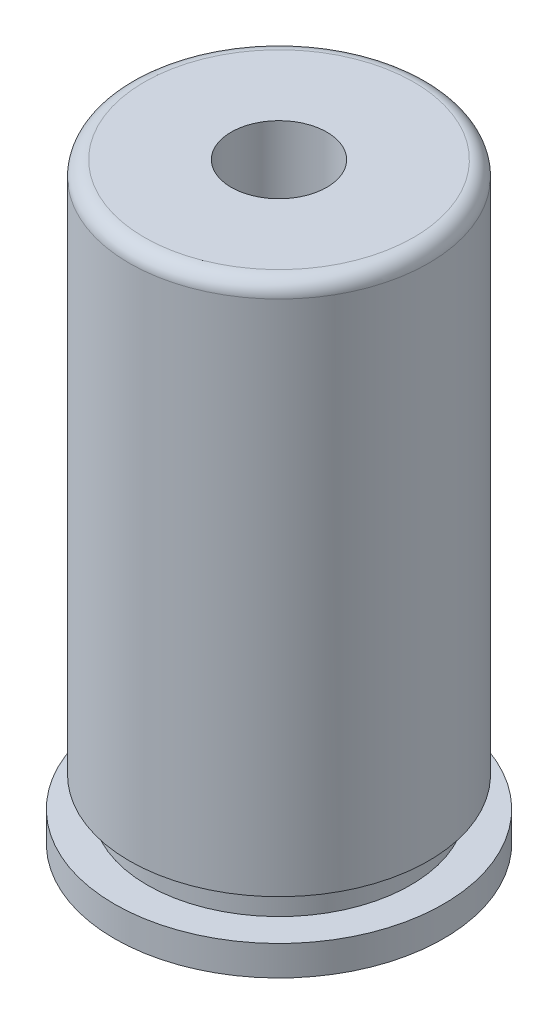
ISO-10303-21;
HEADER;
FILE_DESCRIPTION(('STEP AP214'),'2;1');
FILE_NAME('part.step','',(''),(''),'','','');
FILE_SCHEMA(('AUTOMOTIVE_DESIGN { 1 0 10303 214 1 1 1 1 }'));
ENDSEC;
DATA;
#1=APPLICATION_CONTEXT('core data for automotive mechanical design processes');
#2=APPLICATION_PROTOCOL_DEFINITION('international standard','automotive_design',2000,#1);
#3=PRODUCT_CONTEXT('',#1,'mechanical');
#4=PRODUCT('Part','Part','',(#3));
#5=PRODUCT_RELATED_PRODUCT_CATEGORY('part','',(#4));
#6=PRODUCT_DEFINITION_FORMATION('','',#4);
#7=PRODUCT_DEFINITION_CONTEXT('part definition',#1,'design');
#8=PRODUCT_DEFINITION('design','',#6,#7);
#9=PRODUCT_DEFINITION_SHAPE('','',#8);
#10=(LENGTH_UNIT() NAMED_UNIT(*) SI_UNIT(.MILLI.,.METRE.));
#11=(NAMED_UNIT(*) PLANE_ANGLE_UNIT() SI_UNIT($,.RADIAN.));
#12=(NAMED_UNIT(*) SI_UNIT($,.STERADIAN.) SOLID_ANGLE_UNIT());
#13=UNCERTAINTY_MEASURE_WITH_UNIT(LENGTH_MEASURE(1.E-05),#10,'distance_accuracy_value','');
#14=(GEOMETRIC_REPRESENTATION_CONTEXT(3) GLOBAL_UNCERTAINTY_ASSIGNED_CONTEXT((#13)) GLOBAL_UNIT_ASSIGNED_CONTEXT((#10,
#11,#12)) REPRESENTATION_CONTEXT('',''));
#15=CARTESIAN_POINT('',(0.,0.,0.));
#16=DIRECTION('',(0.,0.,1.));
#17=DIRECTION('',(1.,0.,0.));
#18=AXIS2_PLACEMENT_3D('',#15,#16,#17);
#19=CARTESIAN_POINT('',(0.,0.,0.));
#20=DIRECTION('',(0.,1.,0.));
#21=DIRECTION('',(0.,0.,1.));
#22=AXIS2_PLACEMENT_3D('',#19,#20,#21);
#23=PLANE('',#22);
#24=CARTESIAN_POINT('',(0.,0.,0.));
#25=DIRECTION('',(0.,-1.,0.));
#26=DIRECTION('',(0.,0.,-1.));
#27=AXIS2_PLACEMENT_3D('',#24,#25,#26);
#28=CIRCLE('',#27,2.75);
#29=CARTESIAN_POINT('',(0.,0.,-2.75));
#30=VERTEX_POINT('',#29);
#31=EDGE_CURVE('E128',#30,#30,#28,.F.);
#32=ORIENTED_EDGE('',*,*,#31,.F.);
#33=EDGE_LOOP('',(#32));
#34=FACE_BOUND('',#33,.T.);
#35=ADVANCED_FACE('F16',(#34),#23,.F.);
#36=CARTESIAN_POINT('',(0.,0.,0.));
#37=DIRECTION('',(0.,-1.,0.));
#38=DIRECTION('',(0.,0.,-1.));
#39=AXIS2_PLACEMENT_3D('',#36,#37,#38);
#40=CYLINDRICAL_SURFACE('',#39,2.75);
#41=CARTESIAN_POINT('',(0.,0.5,0.));
#42=DIRECTION('',(0.,-1.,0.));
#43=DIRECTION('',(0.,0.,-1.));
#44=AXIS2_PLACEMENT_3D('',#41,#42,#43);
#45=CIRCLE('',#44,2.75);
#46=CARTESIAN_POINT('',(0.,0.5,-2.75));
#47=VERTEX_POINT('',#46);
#48=EDGE_CURVE('E125',#47,#47,#45,.T.);
#49=ORIENTED_EDGE('',*,*,#48,.T.);
#50=EDGE_LOOP('',(#49));
#51=FACE_BOUND('',#50,.T.);
#52=ORIENTED_EDGE('',*,*,#31,.T.);
#53=EDGE_LOOP('',(#52));
#54=FACE_BOUND('',#53,.T.);
#55=ADVANCED_FACE('F132',(#51,#54),#40,.T.);
#56=CARTESIAN_POINT('',(0.,4.99999999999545,0.));
#57=DIRECTION('',(0.,1.,0.));
#58=DIRECTION('',(0.,0.,1.));
#59=AXIS2_PLACEMENT_3D('',#56,#57,#58);
#60=CONICAL_SURFACE('',#59,0.800000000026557,1.02974425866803);
#61=CARTESIAN_POINT('',(-8.5265128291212E-11,4.51931150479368,0.));
#62=VERTEX_POINT('',#61);
#63=VERTEX_LOOP('',#62);
#64=FACE_BOUND('',#63,.T.);
#65=CARTESIAN_POINT('',(0.,5.,0.));
#66=DIRECTION('',(0.,1.,0.));
#67=DIRECTION('',(0.,0.,1.));
#68=AXIS2_PLACEMENT_3D('',#65,#66,#67);
#69=CIRCLE('',#68,0.8);
#70=CARTESIAN_POINT('',(0.,5.,0.8));
#71=VERTEX_POINT('',#70);
#72=EDGE_CURVE('E88',#71,#71,#69,.T.);
#73=ORIENTED_EDGE('',*,*,#72,.T.);
#74=EDGE_LOOP('',(#73));
#75=FACE_BOUND('',#74,.T.);
#76=ADVANCED_FACE('F138',(#64,#75),#60,.F.);
#77=CARTESIAN_POINT('',(0.,0.5,0.));
#78=DIRECTION('',(0.,-1.,0.));
#79=DIRECTION('',(0.,0.,-1.));
#80=AXIS2_PLACEMENT_3D('',#77,#78,#79);
#81=PLANE('',#80);
#82=CARTESIAN_POINT('',(0.,0.5,0.));
#83=DIRECTION('',(0.,-1.,0.));
#84=DIRECTION('',(0.,0.,-1.));
#85=AXIS2_PLACEMENT_3D('',#82,#83,#84);
#86=CIRCLE('',#85,2.2);
#87=CARTESIAN_POINT('',(0.,0.5,-2.2));
#88=VERTEX_POINT('',#87);
#89=EDGE_CURVE('E120',#88,#88,#86,.F.);
#90=ORIENTED_EDGE('',*,*,#89,.F.);
#91=EDGE_LOOP('',(#90));
#92=FACE_BOUND('',#91,.T.);
#93=ORIENTED_EDGE('',*,*,#48,.F.);
#94=EDGE_LOOP('',(#93));
#95=FACE_BOUND('',#94,.T.);
#96=ADVANCED_FACE('F143',(#92,#95),#81,.F.);
#97=CARTESIAN_POINT('',(0.,4.245277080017,0.));
#98=DIRECTION('',(0.,1.,0.));
#99=DIRECTION('',(0.,0.,1.));
#100=AXIS2_PLACEMENT_3D('',#97,#98,#99);
#101=CYLINDRICAL_SURFACE('',#100,0.8);
#102=ORIENTED_EDGE('',*,*,#72,.F.);
#103=EDGE_LOOP('',(#102));
#104=FACE_BOUND('',#103,.T.);
#105=CARTESIAN_POINT('',(0.,9.9,0.));
#106=DIRECTION('',(0.,1.,0.));
#107=DIRECTION('',(0.,0.,1.));
#108=AXIS2_PLACEMENT_3D('',#105,#106,#107);
#109=CIRCLE('',#108,0.8);
#110=CARTESIAN_POINT('',(0.,9.9,0.8));
#111=VERTEX_POINT('',#110);
#112=EDGE_CURVE('E51',#111,#111,#109,.F.);
#113=ORIENTED_EDGE('',*,*,#112,.F.);
#114=EDGE_LOOP('',(#113));
#115=FACE_BOUND('',#114,.T.);
#116=ADVANCED_FACE('F148',(#104,#115),#101,.F.);
#117=CARTESIAN_POINT('',(0.,1.025,0.));
#118=DIRECTION('',(0.,-1.,0.));
#119=DIRECTION('',(0.,0.,-1.));
#120=AXIS2_PLACEMENT_3D('',#117,#118,#119);
#121=CYLINDRICAL_SURFACE('',#120,2.2);
#122=ORIENTED_EDGE('',*,*,#89,.T.);
#123=EDGE_LOOP('',(#122));
#124=FACE_BOUND('',#123,.T.);
#125=CARTESIAN_POINT('',(0.,1.,0.));
#126=DIRECTION('',(0.,-1.,0.));
#127=DIRECTION('',(0.,0.,-1.));
#128=AXIS2_PLACEMENT_3D('',#125,#126,#127);
#129=CIRCLE('',#128,2.2);
#130=CARTESIAN_POINT('',(0.,1.,-2.2));
#131=VERTEX_POINT('',#130);
#132=EDGE_CURVE('E111',#131,#131,#129,.F.);
#133=ORIENTED_EDGE('',*,*,#132,.F.);
#134=EDGE_LOOP('',(#133));
#135=FACE_BOUND('',#134,.T.);
#136=ADVANCED_FACE('F73',(#124,#135),#121,.T.);
#137=CARTESIAN_POINT('',(0.,9.9,0.));
#138=DIRECTION('',(0.,1.,0.));
#139=DIRECTION('',(0.,0.,1.));
#140=AXIS2_PLACEMENT_3D('',#137,#138,#139);
#141=PLANE('',#140);
#142=ORIENTED_EDGE('',*,*,#112,.T.);
#143=EDGE_LOOP('',(#142));
#144=FACE_BOUND('',#143,.T.);
#145=DIRECTION('',(0.00363438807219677,0.,0.999993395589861));
#146=VECTOR('',#145,1.);
#147=CARTESIAN_POINT('',(-2.25,9.9,-3.47998179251E-13));
#148=LINE('',#147,#146);
#149=CARTESIAN_POINT('',(-2.25000000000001,9.9,-3.37114279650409E-13));
#150=VERTEX_POINT('',#149);
#151=CARTESIAN_POINT('',(-2.24994056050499,9.9,0.0163546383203));
#152=VERTEX_POINT('',#151);
#153=EDGE_CURVE('E36',#150,#152,#148,.T.);
#154=ORIENTED_EDGE('',*,*,#153,.T.);
#155=CARTESIAN_POINT('',(0.,9.9,0.));
#156=DIRECTION('',(0.,-1.,0.));
#157=DIRECTION('',(1.,0.,0.));
#158=AXIS2_PLACEMENT_3D('',#155,#156,#157);
#159=CIRCLE('',#158,2.25);
#160=CARTESIAN_POINT('',(2.25000000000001,9.9,-1.46739265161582E-12));
#161=VERTEX_POINT('',#160);
#162=EDGE_CURVE('E49',#161,#152,#159,.T.);
#163=ORIENTED_EDGE('',*,*,#162,.F.);
#164=DIRECTION('',(-0.00363438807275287,0.,-0.999993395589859));
#165=VECTOR('',#164,1.);
#166=CARTESIAN_POINT('',(2.25,9.9,-1.834494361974E-12));
#167=LINE('',#166,#165);
#168=CARTESIAN_POINT('',(2.24994056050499,9.9,-0.0163546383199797));
#169=VERTEX_POINT('',#168);
#170=EDGE_CURVE('E55',#161,#169,#167,.T.);
#171=ORIENTED_EDGE('',*,*,#170,.T.);
#172=CARTESIAN_POINT('',(-2.25,9.9,-3.48476130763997E-13));
#173=CARTESIAN_POINT('',(-2.25000048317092,9.9,-0.0326492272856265));
#174=CARTESIAN_POINT('',(-2.24928937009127,9.9,-0.0652984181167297));
#175=CARTESIAN_POINT('',(-2.24644742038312,9.9,-0.13053495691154));
#176=CARTESIAN_POINT('',(-2.24431658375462,9.9,-0.163122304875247));
#177=CARTESIAN_POINT('',(-2.23863865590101,9.9,-0.228173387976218));
#178=CARTESIAN_POINT('',(-2.23509156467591,9.9,-0.260637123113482));
#179=CARTESIAN_POINT('',(-2.22658800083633,9.9,-0.325379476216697));
#180=CARTESIAN_POINT('',(-2.22163152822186,9.9,-0.357658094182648));
#181=CARTESIAN_POINT('',(-2.21031855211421,9.9,-0.421969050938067));
#182=CARTESIAN_POINT('',(-2.20396204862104,9.9,-0.454001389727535));
#183=CARTESIAN_POINT('',(-2.18986106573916,9.9,-0.517759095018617));
#184=CARTESIAN_POINT('',(-2.18211658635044,9.9,-0.54948446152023));
#185=CARTESIAN_POINT('',(-2.16525432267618,9.9,-0.61256811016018));
#186=CARTESIAN_POINT('',(-2.15613653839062,9.9,-0.643926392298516));
#187=CARTESIAN_POINT('',(-2.13654494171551,9.9,-0.706216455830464));
#188=CARTESIAN_POINT('',(-2.12607112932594,9.9,-0.737148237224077));
#189=CARTESIAN_POINT('',(-2.10378732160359,9.9,-0.798526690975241));
#190=CARTESIAN_POINT('',(-2.09197732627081,9.9,-0.828973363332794));
#191=CARTESIAN_POINT('',(-2.06704352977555,9.9,-0.889323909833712));
#192=CARTESIAN_POINT('',(-2.05391972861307,9.9,-0.919227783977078));
#193=CARTESIAN_POINT('',(-2.02638318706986,9.9,-0.978436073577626));
#194=CARTESIAN_POINT('',(-2.01197044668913,9.90000000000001,-1.00774048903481));
#195=CARTESIAN_POINT('',(-1.98188333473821,9.89999999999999,-1.06569433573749));
#196=CARTESIAN_POINT('',(-1.96620896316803,9.89999999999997,-1.09434376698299));
#197=CARTESIAN_POINT('',(-1.93362829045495,9.90000000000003,-1.15093336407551));
#198=CARTESIAN_POINT('',(-1.91672198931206,9.90000000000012,-1.17887352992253));
#199=CARTESIAN_POINT('',(-1.88170948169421,9.89999999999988,-1.23399164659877));
#200=CARTESIAN_POINT('',(-1.86360327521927,9.89999999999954,-1.26116959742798));
#201=CARTESIAN_POINT('',(-1.8262252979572,9.90000000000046,-1.31471182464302));
#202=CARTESIAN_POINT('',(-1.80695352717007,9.90000000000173,-1.34107610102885));
#203=CARTESIAN_POINT('',(-1.76728080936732,9.89999999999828,-1.39294089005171));
#204=CARTESIAN_POINT('',(-1.74687986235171,9.89999999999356,-1.41844140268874));
#205=CARTESIAN_POINT('',(-1.70498792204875,9.90000000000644,-1.46853085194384));
#206=CARTESIAN_POINT('',(-1.68349692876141,9.90000000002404,-1.4931197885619));
#207=CARTESIAN_POINT('',(-1.63946384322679,9.89999999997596,-1.54133761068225));
#208=CARTESIAN_POINT('',(-1.61692175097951,9.89999999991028,-1.56496649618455));
#209=CARTESIAN_POINT('',(-1.56990084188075,9.90000000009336,-1.6121649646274));
#210=CARTESIAN_POINT('',(-1.54538055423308,9.90000000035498,-1.63569324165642));
#211=CARTESIAN_POINT('',(-1.49531218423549,9.89999999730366,-1.68162844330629));
#212=CARTESIAN_POINT('',(-1.46976412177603,9.89999999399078,-1.70403538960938));
#213=CARTESIAN_POINT('',(-1.41768973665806,9.89999996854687,-1.74768189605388));
#214=CARTESIAN_POINT('',(-1.39116341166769,9.8999999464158,-1.76892145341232));
#215=CARTESIAN_POINT('',(-1.33718331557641,9.89999986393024,-1.81019069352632));
#216=CARTESIAN_POINT('',(-1.30972952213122,9.89999980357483,-1.83022034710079));
#217=CARTESIAN_POINT('',(-1.26790053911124,9.89999964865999,-1.85933001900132));
#218=CARTESIAN_POINT('',(-1.25384881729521,9.89999958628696,-1.86887787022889));
#219=CARTESIAN_POINT('',(-1.22554187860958,9.89999945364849,-1.88764195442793));
#220=CARTESIAN_POINT('',(-1.21128683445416,9.89999938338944,-1.89685844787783));
#221=CARTESIAN_POINT('',(-1.16820588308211,9.89999921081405,-1.92400280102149));
#222=CARTESIAN_POINT('',(-1.13906076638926,9.89999914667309,-1.94142789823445));
#223=CARTESIAN_POINT('',(-1.079992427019,9.89999914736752,-1.97489176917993));
#224=CARTESIAN_POINT('',(-1.05006930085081,9.89999921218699,-1.99093071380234));
#225=CARTESIAN_POINT('',(-0.989521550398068,9.89999944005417,-2.0216144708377));
#226=CARTESIAN_POINT('',(-0.958897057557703,9.89999960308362,-2.03625954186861));
#227=CARTESIAN_POINT('',(-0.896972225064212,9.89999987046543,-2.06401848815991));
#228=CARTESIAN_POINT('',(-0.865672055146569,9.89999997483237,-2.07713274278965));
#229=CARTESIAN_POINT('',(-0.818567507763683,9.90000001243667,-2.09585799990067));
#230=CARTESIAN_POINT('',(-0.802933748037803,9.90000000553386,-2.10190881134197));
#231=CARTESIAN_POINT('',(-0.736525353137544,9.89999998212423,-2.12677228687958));
#232=CARTESIAN_POINT('',(-0.68512103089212,9.89999997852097,-2.1439581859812));
#233=CARTESIAN_POINT('',(-0.607602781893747,9.89999991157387,-2.16679466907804));
#234=CARTESIAN_POINT('',(-0.581896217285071,9.89999987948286,-2.17387248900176));
#235=CARTESIAN_POINT('',(-0.52652534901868,9.89999981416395,-2.18805341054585));
#236=CARTESIAN_POINT('',(-0.496823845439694,9.89999978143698,-2.19501358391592));
#237=CARTESIAN_POINT('',(-0.45419516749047,9.89999975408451,-2.20407723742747));
#238=CARTESIAN_POINT('',(-0.441372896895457,9.89999974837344,-2.20668474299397));
#239=CARTESIAN_POINT('',(-0.413148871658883,9.89999974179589,-2.21216419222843));
#240=CARTESIAN_POINT('',(-0.397737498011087,9.89999974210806,-2.21498675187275));
#241=CARTESIAN_POINT('',(-0.351420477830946,9.89999974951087,-2.22296609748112));
#242=CARTESIAN_POINT('',(-0.320429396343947,9.89999976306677,-2.22763509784));
#243=CARTESIAN_POINT('',(-0.258280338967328,9.89999980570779,-2.23566027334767));
#244=CARTESIAN_POINT('',(-0.227122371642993,9.89999983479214,-2.23901651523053));
#245=CARTESIAN_POINT('',(-0.164694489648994,9.89999989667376,-2.24441338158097));
#246=CARTESIAN_POINT('',(-0.1334245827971,9.8999999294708,-2.24645409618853));
#247=CARTESIAN_POINT('',(-0.0708292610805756,9.89999998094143,-2.24920762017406));
#248=CARTESIAN_POINT('',(-0.0395038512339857,9.89999999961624,-2.2499205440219));
#249=CARTESIAN_POINT('',(0.0231927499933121,9.9000000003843,-2.25004982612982));
#250=CARTESIAN_POINT('',(0.0545639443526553,9.89999998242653,-2.24946437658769));
#251=CARTESIAN_POINT('',(0.117253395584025,9.89999996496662,-2.24702476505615));
#252=CARTESIAN_POINT('',(0.148571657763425,9.8999999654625,-2.24517073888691));
#253=CARTESIAN_POINT('',(0.211105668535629,9.89999997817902,-2.24019387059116));
#254=CARTESIAN_POINT('',(0.242321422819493,9.899999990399,-2.23707110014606));
#255=CARTESIAN_POINT('',(0.304598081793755,9.90000000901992,-2.22954530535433));
#256=CARTESIAN_POINT('',(0.335658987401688,9.9000000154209,-2.22514228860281));
#257=CARTESIAN_POINT('',(0.382103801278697,9.89999986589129,-2.21763556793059));
#258=CARTESIAN_POINT('',(0.397561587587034,9.89999978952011,-2.21498283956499));
#259=CARTESIAN_POINT('',(0.419342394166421,9.89999972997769,-2.21096166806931));
#260=CARTESIAN_POINT('',(0.425695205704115,9.89999971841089,-2.20975462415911));
#261=CARTESIAN_POINT('',(0.460103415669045,9.89999967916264,-2.20304821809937));
#262=CARTESIAN_POINT('',(0.488052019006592,9.89999973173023,-2.1969916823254));
#263=CARTESIAN_POINT('',(0.550071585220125,9.89999982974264,-2.18231252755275));
#264=CARTESIAN_POINT('',(0.584078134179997,9.89999987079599,-2.17341991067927));
#265=CARTESIAN_POINT('',(0.665604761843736,9.89999995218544,-2.15003766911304));
#266=CARTESIAN_POINT('',(0.712901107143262,9.89999998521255,-2.13475380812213));
#267=CARTESIAN_POINT('',(0.779503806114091,9.89999999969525,-2.11079206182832));
#268=CARTESIAN_POINT('',(0.79927140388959,9.89999999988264,-2.10336715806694));
#269=CARTESIAN_POINT('',(0.850572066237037,9.90000000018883,-2.08329383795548));
#270=CARTESIAN_POINT('',(0.881939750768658,9.90000000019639,-2.07021778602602));
#271=CARTESIAN_POINT('',(0.944054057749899,9.89999999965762,-2.04267114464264));
#272=CARTESIAN_POINT('',(0.974800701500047,9.89999999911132,-2.02820060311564));
#273=CARTESIAN_POINT('',(1.03561723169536,9.89999998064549,-1.99790176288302));
#274=CARTESIAN_POINT('',(1.06568712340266,9.8999999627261,-1.98207347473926));
#275=CARTESIAN_POINT('',(1.12508965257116,9.89999988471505,-1.94908571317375));
#276=CARTESIAN_POINT('',(1.15442227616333,9.8999998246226,-1.93192621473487));
#277=CARTESIAN_POINT('',(1.19782526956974,9.89999965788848,-1.90522191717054));
#278=CARTESIAN_POINT('',(1.21219426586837,9.89999958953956,-1.89615919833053));
#279=CARTESIAN_POINT('',(1.24071026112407,9.89999944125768,-1.87771423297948));
#280=CARTESIAN_POINT('',(1.25485742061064,9.89999936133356,-1.86833223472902));
#281=CARTESIAN_POINT('',(1.29696116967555,9.89999916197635,-1.83969352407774));
#282=CARTESIAN_POINT('',(1.32458362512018,9.89999908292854,-1.81994188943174));
#283=CARTESIAN_POINT('',(1.37886613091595,9.89999906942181,-1.77916838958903));
#284=CARTESIAN_POINT('',(1.40552630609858,9.89999913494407,-1.75814669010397));
#285=CARTESIAN_POINT('',(1.45784700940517,9.89999938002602,-1.71490129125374));
#286=CARTESIAN_POINT('',(1.48350773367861,9.89999955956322,-1.69267782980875));
#287=CARTESIAN_POINT('',(1.53368955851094,9.89999985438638,-1.64699446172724));
#288=CARTESIAN_POINT('',(1.55821095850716,9.89999996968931,-1.62353488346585));
#289=CARTESIAN_POINT('',(1.59539149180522,9.90000001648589,-1.58664366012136));
#290=CARTESIAN_POINT('',(1.60835985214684,9.90000000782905,-1.57351854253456));
#291=CARTESIAN_POINT('',(1.66171336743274,9.89999997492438,-1.51819517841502));
#292=CARTESIAN_POINT('',(1.70066389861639,9.89999995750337,-1.47458013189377));
#293=CARTESIAN_POINT('',(1.75613213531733,9.89999982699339,-1.40736525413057));
#294=CARTESIAN_POINT('',(1.77399341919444,9.89999976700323,-1.38485397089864));
#295=CARTESIAN_POINT('',(1.81143887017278,9.89999964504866,-1.33573325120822));
#296=CARTESIAN_POINT('',(1.83088098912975,9.89999958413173,-1.30901457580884));
#297=CARTESIAN_POINT('',(1.8578369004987,9.89999953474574,-1.2701639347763));
#298=CARTESIAN_POINT('',(1.86584876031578,9.89999952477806,-1.25837414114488));
#299=CARTESIAN_POINT('',(1.88314800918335,9.89999951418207,-1.23237965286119));
#300=CARTESIAN_POINT('',(1.89238744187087,9.89999951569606,-1.21814299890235));
#301=CARTESIAN_POINT('',(1.91961302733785,9.89999953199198,-1.17512345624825));
#302=CARTESIAN_POINT('',(1.93710856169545,9.89999955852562,-1.14602798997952));
#303=CARTESIAN_POINT('',(1.97074694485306,9.89999963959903,-1.08706972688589));
#304=CARTESIAN_POINT('',(1.98688989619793,9.89999969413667,-1.05720698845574));
#305=CARTESIAN_POINT('',(2.01779342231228,9.89999980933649,-0.996777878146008));
#306=CARTESIAN_POINT('',(2.03255413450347,9.89999986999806,-0.966211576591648));
#307=CARTESIAN_POINT('',(2.06065161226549,9.89999996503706,-0.904435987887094));
#308=CARTESIAN_POINT('',(2.07398855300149,9.89999999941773,-0.873226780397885));
#309=CARTESIAN_POINT('',(2.09829421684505,9.90000000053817,-0.812628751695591));
#310=CARTESIAN_POINT('',(2.10936579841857,9.89999997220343,-0.783281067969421));
#311=CARTESIAN_POINT('',(2.13031778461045,9.89999993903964,-0.724167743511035));
#312=CARTESIAN_POINT('',(2.14019833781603,9.89999993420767,-0.694402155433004));
#313=CARTESIAN_POINT('',(2.15874948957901,9.89999994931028,-0.634498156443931));
#314=CARTESIAN_POINT('',(2.167420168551,9.89999996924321,-0.604359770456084));
#315=CARTESIAN_POINT('',(2.18351832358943,9.90000001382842,-0.543753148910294));
#316=CARTESIAN_POINT('',(2.19094580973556,9.90000003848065,-0.513284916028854));
#317=CARTESIAN_POINT('',(2.20119125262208,9.89999989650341,-0.467462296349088));
#318=CARTESIAN_POINT('',(2.20445020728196,9.89999981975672,-0.452205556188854));
#319=CARTESIAN_POINT('',(2.20869749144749,9.89999976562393,-0.430972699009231));
#320=CARTESIAN_POINT('',(2.20985494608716,9.89999975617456,-0.425030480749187));
#321=CARTESIAN_POINT('',(2.21631669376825,9.89999972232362,-0.39105688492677));
#322=CARTESIAN_POINT('',(2.22106346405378,9.89999977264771,-0.362918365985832));
#323=CARTESIAN_POINT('',(2.23053060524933,9.89999986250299,-0.29950145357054));
#324=CARTESIAN_POINT('',(2.23495412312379,9.89999989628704,-0.264178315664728));
#325=CARTESIAN_POINT('',(2.23969865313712,9.89999993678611,-0.217222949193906));
#326=CARTESIAN_POINT('',(2.2407757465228,9.89999994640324,-0.205663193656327));
#327=CARTESIAN_POINT('',(2.244893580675,9.89999998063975,-0.157452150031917));
#328=CARTESIAN_POINT('',(2.24712988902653,9.89999999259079,-0.120726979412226));
#329=CARTESIAN_POINT('',(2.24928563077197,9.89999999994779,-0.0616096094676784));
#330=CARTESIAN_POINT('',(2.24976937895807,9.89999999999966,-0.0392355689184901));
#331=CARTESIAN_POINT('',(2.24993809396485,9.9,-0.0166914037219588));
#332=CARTESIAN_POINT('',(2.2499393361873,9.9,-0.0165230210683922));
#333=CARTESIAN_POINT('',(2.249940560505,9.9,-0.0163546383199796));
#334=B_SPLINE_CURVE_WITH_KNOTS('',3,(#172,#173,#174,#175,#176,#177,#178,#179,#180,#181,#182,
#183,#184,#185,#186,#187,#188,#189,#190,#191,#192,#193,#194,#195,#196,#197,#198,#199,#200,#201,
#202,#203,#204,#205,#206,#207,#208,#209,#210,#211,#212,#213,#214,#215,#216,#217,#218,#219,#220,
#221,#222,#223,#224,#225,#226,#227,#228,#229,#230,#231,#232,#233,#234,#235,#236,#237,#238,#239,
#240,#241,#242,#243,#244,#245,#246,#247,#248,#249,#250,#251,#252,#253,#254,#255,#256,#257,#258,
#259,#260,#261,#262,#263,#264,#265,#266,#267,#268,#269,#270,#271,#272,#273,#274,#275,#276,#277,
#278,#279,#280,#281,#282,#283,#284,#285,#286,#287,#288,#289,#290,#291,#292,#293,#294,#295,#296,
#297,#298,#299,#300,#301,#302,#303,#304,#305,#306,#307,#308,#309,#310,#311,#312,#313,#314,#315,
#316,#317,#318,#319,#320,#321,#322,#323,#324,#325,#326,#327,#328,#329,#330,#331,#332,#333),
.UNSPECIFIED.,.F.,.F.,(4,2,2,2,2,2,2,2,2,2,2,2,2,2,2,2,2,2,2,2,2,2,2,2,2,2,2,2,2,2,2,2,2,2,2,2,
2,2,2,2,2,2,2,2,2,2,2,2,2,2,2,2,2,2,2,2,2,2,2,2,2,2,2,2,2,2,2,2,2,2,2,2,2,2,2,2,2,2,2,2,4),(0.,
0.0979398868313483,0.195879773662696,0.293819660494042,0.39175954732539,0.489699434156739,
0.587639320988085,0.685579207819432,0.783519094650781,0.881458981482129,0.979398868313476,
1.07733875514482,1.17527864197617,1.27321852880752,1.37115841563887,1.46909830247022,
1.56703818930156,1.66497807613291,1.76291796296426,1.86483169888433,1.96674346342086,
2.0686554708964,2.17056993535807,2.2215319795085,2.27245304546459,2.37428278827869,
2.47609995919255,2.57789820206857,2.67967116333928,2.72996262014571,2.89238852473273,
2.9723667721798,3.06385406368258,3.10310671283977,3.1501067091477,3.24409892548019,
3.33808636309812,3.43206736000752,3.52604025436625,3.6201440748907,3.71423782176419,
3.80832625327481,3.90241412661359,3.94946176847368,3.9688609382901,4.05462721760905,
4.16004400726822,4.30902942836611,4.37237280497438,4.47428778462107,4.57619926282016,
4.67810994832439,4.78002254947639,4.83098359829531,4.88190588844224,4.98373782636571,
5.08555650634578,5.18735510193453,5.28912678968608,5.34448007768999,5.51968548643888,
5.6058807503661,5.70497208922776,5.74773346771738,5.7986455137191,5.90045864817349,
6.00226405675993,6.10405933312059,6.20584207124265,6.29991646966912,6.39397911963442,
6.48803551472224,6.58209114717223,6.62889028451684,6.64705173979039,6.73263702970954,
6.83938845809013,6.87421758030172,6.98454388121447,7.05167309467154,7.05217825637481),.UNSPECIFIED.);
#335=EDGE_CURVE('E47',#169,#150,#334,.F.);
#336=ORIENTED_EDGE('',*,*,#335,.T.);
#337=EDGE_LOOP('',(#154,#163,#171,#336));
#338=FACE_BOUND('',#337,.T.);
#339=ADVANCED_FACE('F54',(#144,#338),#141,.T.);
#340=CARTESIAN_POINT('',(0.,1.,0.));
#341=DIRECTION('',(0.,-1.,0.));
#342=DIRECTION('',(0.,0.,-1.));
#343=AXIS2_PLACEMENT_3D('',#340,#341,#342);
#344=PLANE('',#343);
#345=ORIENTED_EDGE('',*,*,#132,.T.);
#346=EDGE_LOOP('',(#345));
#347=FACE_BOUND('',#346,.T.);
#348=CARTESIAN_POINT('',(0.,1.,0.));
#349=DIRECTION('',(0.,1.,0.));
#350=DIRECTION('',(0.,0.,1.));
#351=AXIS2_PLACEMENT_3D('',#348,#349,#350);
#352=CIRCLE('',#351,2.5);
#353=CARTESIAN_POINT('',(0.,1.,2.5));
#354=VERTEX_POINT('',#353);
#355=EDGE_CURVE('E27',#354,#354,#352,.T.);
#356=ORIENTED_EDGE('',*,*,#355,.F.);
#357=EDGE_LOOP('',(#356));
#358=FACE_BOUND('',#357,.T.);
#359=ADVANCED_FACE('F72',(#347,#358),#344,.T.);
#360=CARTESIAN_POINT('',(0.,9.65,0.));
#361=DIRECTION('',(0.,1.,0.));
#362=DIRECTION('',(0.999971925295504,0.,-0.00749323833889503));
#363=AXIS2_PLACEMENT_3D('',#360,#361,#362);
#364=TOROIDAL_SURFACE('',#363,2.25,0.25);
#365=ORIENTED_EDGE('',*,*,#153,.F.);
#366=ORIENTED_EDGE('',*,*,#335,.F.);
#367=ORIENTED_EDGE('',*,*,#170,.F.);
#368=ORIENTED_EDGE('',*,*,#162,.T.);
#369=EDGE_LOOP('',(#365,#366,#367,#368));
#370=FACE_BOUND('',#369,.T.);
#371=CARTESIAN_POINT('',(0.,9.65,0.));
#372=DIRECTION('',(0.,1.,0.));
#373=DIRECTION('',(0.,0.,1.));
#374=AXIS2_PLACEMENT_3D('',#371,#372,#373);
#375=CIRCLE('',#374,2.5);
#376=CARTESIAN_POINT('',(0.,9.65,2.5));
#377=VERTEX_POINT('',#376);
#378=EDGE_CURVE('E11',#377,#377,#375,.F.);
#379=ORIENTED_EDGE('',*,*,#378,.F.);
#380=EDGE_LOOP('',(#379));
#381=FACE_BOUND('',#380,.T.);
#382=ADVANCED_FACE('F45',(#370,#381),#364,.T.);
#383=CARTESIAN_POINT('',(0.,0.,0.));
#384=DIRECTION('',(0.,1.,0.));
#385=DIRECTION('',(0.,0.,1.));
#386=AXIS2_PLACEMENT_3D('',#383,#384,#385);
#387=CYLINDRICAL_SURFACE('',#386,2.5);
#388=ORIENTED_EDGE('',*,*,#355,.T.);
#389=EDGE_LOOP('',(#388));
#390=FACE_BOUND('',#389,.T.);
#391=ORIENTED_EDGE('',*,*,#378,.T.);
#392=EDGE_LOOP('',(#391));
#393=FACE_BOUND('',#392,.T.);
#394=ADVANCED_FACE('F98',(#390,#393),#387,.T.);
#395=CLOSED_SHELL('',(#35,#55,#76,#96,#116,#136,#339,#359,#382,#394));
#396=MANIFOLD_SOLID_BREP('B1',#395);
#397=ADVANCED_BREP_SHAPE_REPRESENTATION('',(#18,#396),#14);
#398=SHAPE_DEFINITION_REPRESENTATION(#9,#397);
ENDSEC;
END-ISO-10303-21;
